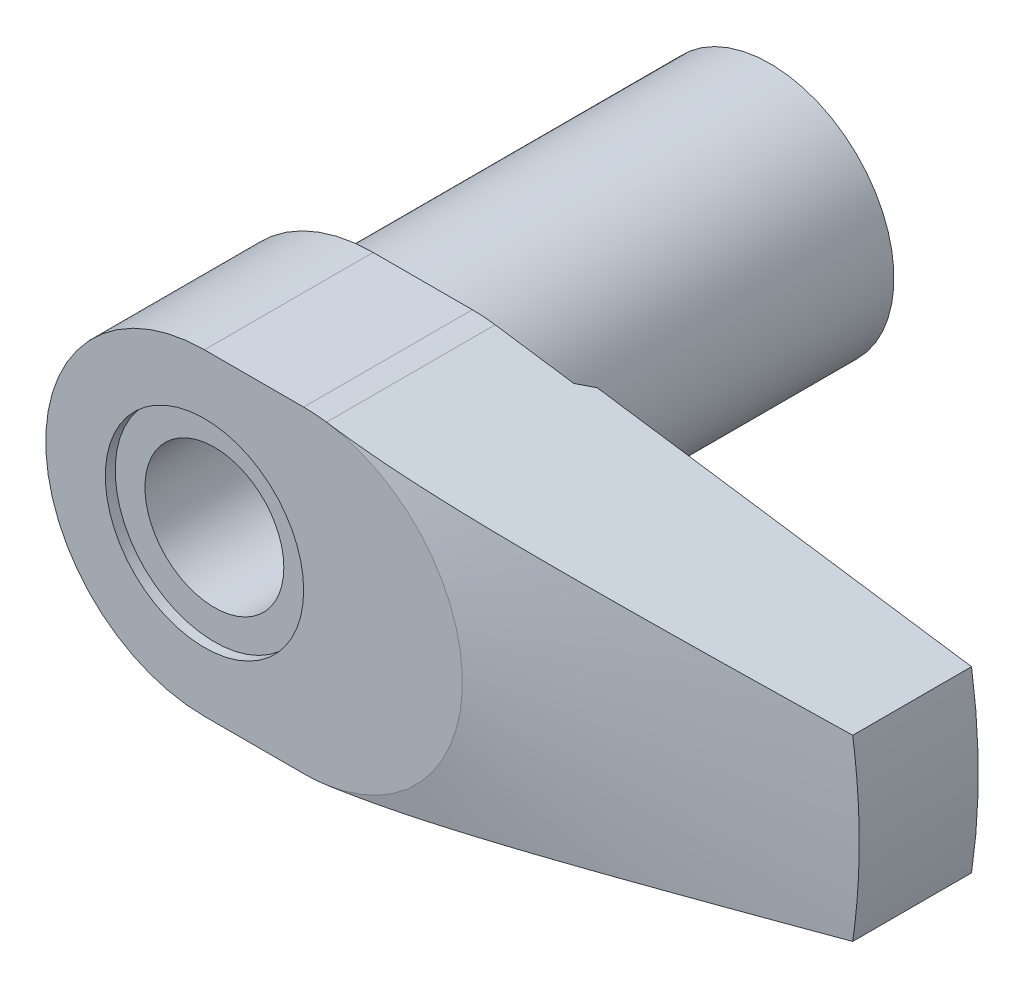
ISO-10303-21;
HEADER;
FILE_DESCRIPTION(('STEP AP214'),'2;1');
FILE_NAME('part.step','',(''),(''),'','','');
FILE_SCHEMA(('AUTOMOTIVE_DESIGN { 1 0 10303 214 1 1 1 1 }'));
ENDSEC;
DATA;
#1=APPLICATION_CONTEXT('core data for automotive mechanical design processes');
#2=APPLICATION_PROTOCOL_DEFINITION('international standard','automotive_design',2000,#1);
#3=PRODUCT_CONTEXT('',#1,'mechanical');
#4=PRODUCT('Part','Part','',(#3));
#5=PRODUCT_RELATED_PRODUCT_CATEGORY('part','',(#4));
#6=PRODUCT_DEFINITION_FORMATION('','',#4);
#7=PRODUCT_DEFINITION_CONTEXT('part definition',#1,'design');
#8=PRODUCT_DEFINITION('design','',#6,#7);
#9=PRODUCT_DEFINITION_SHAPE('','',#8);
#10=(LENGTH_UNIT() NAMED_UNIT(*) SI_UNIT(.MILLI.,.METRE.));
#11=(NAMED_UNIT(*) PLANE_ANGLE_UNIT() SI_UNIT($,.RADIAN.));
#12=(NAMED_UNIT(*) SI_UNIT($,.STERADIAN.) SOLID_ANGLE_UNIT());
#13=UNCERTAINTY_MEASURE_WITH_UNIT(LENGTH_MEASURE(1.E-05),#10,'distance_accuracy_value','');
#14=(GEOMETRIC_REPRESENTATION_CONTEXT(3) GLOBAL_UNCERTAINTY_ASSIGNED_CONTEXT((#13)) GLOBAL_UNIT_ASSIGNED_CONTEXT((#10,
#11,#12)) REPRESENTATION_CONTEXT('',''));
#15=CARTESIAN_POINT('',(0.,0.,0.));
#16=DIRECTION('',(0.,0.,1.));
#17=DIRECTION('',(1.,0.,0.));
#18=AXIS2_PLACEMENT_3D('',#15,#16,#17);
#19=CARTESIAN_POINT('',(59.3211597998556,9.,39.));
#20=DIRECTION('',(0.143824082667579,0.989603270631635,0.));
#21=DIRECTION('',(-0.989603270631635,0.143824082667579,0.));
#22=AXIS2_PLACEMENT_3D('',#19,#20,#21);
#23=PLANE('',#22);
#24=DIRECTION('',(0.,0.,1.));
#25=VECTOR('',#24,1.);
#26=CARTESIAN_POINT('',(12.3011853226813,15.8336523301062,39.));
#27=LINE('',#26,#25);
#28=CARTESIAN_POINT('',(12.3011853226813,15.8336523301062,40.));
#29=VERTEX_POINT('',#28);
#30=CARTESIAN_POINT('',(12.3011853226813,15.8336523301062,57.));
#31=VERTEX_POINT('',#30);
#32=EDGE_CURVE('E117',#29,#31,#27,.T.);
#33=ORIENTED_EDGE('',*,*,#32,.T.);
#34=CARTESIAN_POINT('',(12.3009853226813,15.8336813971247,56.9999999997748));
#35=CARTESIAN_POINT('',(12.6349091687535,15.785150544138,57.0000070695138));
#36=CARTESIAN_POINT('',(12.9688301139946,15.7366201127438,56.9981170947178));
#37=CARTESIAN_POINT('',(13.6366278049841,15.6395656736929,56.9905970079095));
#38=CARTESIAN_POINT('',(13.9705045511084,15.5910416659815,56.984966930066));
#39=CARTESIAN_POINT('',(14.9719359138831,15.4454985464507,56.9625492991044));
#40=CARTESIAN_POINT('',(15.6393758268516,15.3484961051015,56.9402343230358));
#41=CARTESIAN_POINT('',(16.9731230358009,15.1546558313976,56.8819118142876));
#42=CARTESIAN_POINT('',(17.6394308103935,15.0578179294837,56.8459151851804));
#43=CARTESIAN_POINT('',(18.9713017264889,14.8642503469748,56.7617059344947));
#44=CARTESIAN_POINT('',(19.6368648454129,14.7675206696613,56.7134929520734));
#45=CARTESIAN_POINT('',(20.9663767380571,14.5742959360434,56.6065704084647));
#46=CARTESIAN_POINT('',(21.6303264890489,14.4778007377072,56.5478731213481));
#47=CARTESIAN_POINT('',(22.9573852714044,14.2849325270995,56.4215740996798));
#48=CARTESIAN_POINT('',(23.6204943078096,14.1885595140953,56.3539724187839));
#49=CARTESIAN_POINT('',(24.9460835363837,13.9959048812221,56.211329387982));
#50=CARTESIAN_POINT('',(25.6085635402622,13.8996232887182,56.1362862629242));
#51=CARTESIAN_POINT('',(26.9328107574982,13.7071636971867,55.9800554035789));
#52=CARTESIAN_POINT('',(27.5945779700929,13.6109856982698,55.8988676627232));
#53=CARTESIAN_POINT('',(28.9051223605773,13.4205176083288,55.7329867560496));
#54=CARTESIAN_POINT('',(29.5539112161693,13.3262258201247,55.648387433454));
#55=CARTESIAN_POINT('',(30.8509595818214,13.1377191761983,55.4751347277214));
#56=CARTESIAN_POINT('',(31.4992190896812,13.0435043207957,55.3864813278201));
#57=CARTESIAN_POINT('',(33.4433276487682,12.7609571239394,55.115496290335));
#58=CARTESIAN_POINT('',(34.7384906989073,12.572724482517,54.9281418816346));
#59=CARTESIAN_POINT('',(37.3274120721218,12.1964633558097,54.5440891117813));
#60=CARTESIAN_POINT('',(38.6211704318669,12.0084348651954,54.3473910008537));
#61=CARTESIAN_POINT('',(41.2076703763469,11.6325256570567,53.9472650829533));
#62=CARTESIAN_POINT('',(42.5004119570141,11.4446449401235,53.7438372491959));
#63=CARTESIAN_POINT('',(45.0880466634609,11.0685708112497,53.3315720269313));
#64=CARTESIAN_POINT('',(46.382938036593,10.8803776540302,53.1227234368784));
#65=CARTESIAN_POINT('',(48.9721284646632,10.5040774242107,52.7012905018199));
#66=CARTESIAN_POINT('',(50.2664275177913,10.3159703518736,52.4887061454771));
#67=CARTESIAN_POINT('',(52.8543782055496,9.93985029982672,52.0607120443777));
#68=CARTESIAN_POINT('',(54.1480299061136,9.75183731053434,51.8453027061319));
#69=CARTESIAN_POINT('',(56.7349541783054,9.37586643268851,51.4122210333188));
#70=CARTESIAN_POINT('',(58.0282267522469,9.1879085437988,51.1945487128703));
#71=CARTESIAN_POINT('',(59.3213597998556,8.99997093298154,50.9760395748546));
#72=B_SPLINE_CURVE_WITH_KNOTS('',3,(#34,#35,#36,#37,#38,#39,#40,#41,#42,#43,#44,#45,#46,#47,#48,
#49,#50,#51,#52,#53,#54,#55,#56,#57,#58,#59,#60,#61,#62,#63,#64,#65,#66,#67,#68,#69,#70,#71),
.UNSPECIFIED.,.F.,.F.,(4,2,2,2,2,2,2,2,2,2,2,2,2,2,2,2,2,2,4),(0.,1.01228518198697,
2.02456111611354,4.04885787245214,6.07154473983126,8.09429135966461,10.1146852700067,
12.1350670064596,14.1559318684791,16.1767988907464,18.1599062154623,20.1430217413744,
24.1093017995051,28.0754757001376,32.0416653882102,36.0168318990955,39.9920104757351,
43.9666231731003,47.9412110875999),.UNSPECIFIED.);
#73=CARTESIAN_POINT('',(59.3211597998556,9.,50.9760733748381));
#74=VERTEX_POINT('',#73);
#75=EDGE_CURVE('E95',#31,#74,#72,.T.);
#76=ORIENTED_EDGE('',*,*,#75,.T.);
#77=DIRECTION('',(0.,0.,1.));
#78=VECTOR('',#77,1.);
#79=CARTESIAN_POINT('',(59.3211597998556,9.,39.));
#80=LINE('',#79,#78);
#81=CARTESIAN_POINT('',(59.3211597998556,9.,39.));
#82=VERTEX_POINT('',#81);
#83=EDGE_CURVE('E123',#82,#74,#80,.T.);
#84=ORIENTED_EDGE('',*,*,#83,.F.);
#85=DIRECTION('',(-0.989603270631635,0.143824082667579,0.));
#86=VECTOR('',#85,1.);
#87=CARTESIAN_POINT('',(59.3211597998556,9.,39.));
#88=LINE('',#87,#86);
#89=CARTESIAN_POINT('',(21.592449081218,14.48330565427,39.));
#90=VERTEX_POINT('',#89);
#91=EDGE_CURVE('E138',#82,#90,#88,.T.);
#92=ORIENTED_EDGE('',*,*,#91,.T.);
#93=CARTESIAN_POINT('',(21.5927159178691,14.4832668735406,38.9998));
#94=CARTESIAN_POINT('',(21.4802697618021,14.4996092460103,39.0840809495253));
#95=CARTESIAN_POINT('',(21.3676650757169,14.5159746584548,39.1681460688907));
#96=CARTESIAN_POINT('',(21.1421297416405,14.5487528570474,39.3358245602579));
#97=CARTESIAN_POINT('',(21.0291990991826,14.5651656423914,39.4194379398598));
#98=CARTESIAN_POINT('',(20.8029990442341,14.5980404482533,39.5861957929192));
#99=CARTESIAN_POINT('',(20.6897296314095,14.6145024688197,39.6693402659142));
#100=CARTESIAN_POINT('',(20.4628388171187,14.6474776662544,39.8351414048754));
#101=CARTESIAN_POINT('',(20.349217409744,14.6639908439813,39.9177980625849));
#102=CARTESIAN_POINT('',(20.2354152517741,14.6805302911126,40.0002));
#103=B_SPLINE_CURVE_WITH_KNOTS('',3,(#93,#94,#95,#96,#97,#98,#99,#100,#101,#102),.UNSPECIFIED.,
.F.,.F.,(4,2,2,2,4),(0.,0.424417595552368,0.848828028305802,1.27323887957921,1.69765689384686),.UNSPECIFIED.);
#104=CARTESIAN_POINT('',(20.2356914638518,14.6804901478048,40.));
#105=VERTEX_POINT('',#104);
#106=EDGE_CURVE('E192',#90,#105,#103,.T.);
#107=ORIENTED_EDGE('',*,*,#106,.T.);
#108=DIRECTION('',(0.989603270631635,-0.143824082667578,0.));
#109=VECTOR('',#108,1.);
#110=CARTESIAN_POINT('',(12.3011853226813,15.8336523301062,40.));
#111=LINE('',#110,#109);
#112=EDGE_CURVE('E119',#29,#105,#111,.T.);
#113=ORIENTED_EDGE('',*,*,#112,.F.);
#114=EDGE_LOOP('',(#33,#76,#84,#92,#107,#113));
#115=FACE_BOUND('',#114,.T.);
#116=ADVANCED_FACE('F14',(#115),#23,.T.);
#117=CARTESIAN_POINT('',(59.3211597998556,-9.,39.));
#118=DIRECTION('',(0.143824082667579,-0.989603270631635,0.));
#119=DIRECTION('',(0.989603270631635,0.143824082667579,0.));
#120=AXIS2_PLACEMENT_3D('',#117,#118,#119);
#121=PLANE('',#120);
#122=DIRECTION('',(0.,0.,1.));
#123=VECTOR('',#122,1.);
#124=CARTESIAN_POINT('',(59.3211597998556,-9.,39.));
#125=LINE('',#124,#123);
#126=CARTESIAN_POINT('',(59.3211597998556,-9.,39.));
#127=VERTEX_POINT('',#126);
#128=CARTESIAN_POINT('',(59.3211597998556,-9.,50.9760733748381));
#129=VERTEX_POINT('',#128);
#130=EDGE_CURVE('E145',#127,#129,#125,.T.);
#131=ORIENTED_EDGE('',*,*,#130,.T.);
#132=CARTESIAN_POINT('',(59.3213597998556,-8.99997093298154,50.9760395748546));
#133=CARTESIAN_POINT('',(58.3469494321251,-9.14158695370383,51.1407059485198));
#134=CARTESIAN_POINT('',(57.3724576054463,-9.2832148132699,51.3048819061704));
#135=CARTESIAN_POINT('',(55.4232742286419,-9.56649955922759,51.6320245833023));
#136=CARTESIAN_POINT('',(54.4485826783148,-9.7081564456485,51.7949913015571));
#137=CARTESIAN_POINT('',(52.4991016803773,-9.99148444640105,52.1194640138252));
#138=CARTESIAN_POINT('',(51.5243122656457,-10.1331555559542,52.2809702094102));
#139=CARTESIAN_POINT('',(49.5744519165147,-10.4165386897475,52.6022387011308));
#140=CARTESIAN_POINT('',(48.5993809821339,-10.5582507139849,52.7620009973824));
#141=CARTESIAN_POINT('',(46.6499435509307,-10.8415723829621,53.0792219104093));
#142=CARTESIAN_POINT('',(45.6755774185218,-10.9831819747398,53.2366828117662));
#143=CARTESIAN_POINT('',(43.7264316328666,-11.2664612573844,53.5489681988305));
#144=CARTESIAN_POINT('',(42.7516519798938,-11.4081309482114,53.7037926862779));
#145=CARTESIAN_POINT('',(40.8014288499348,-11.6915668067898,54.0101609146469));
#146=CARTESIAN_POINT('',(39.8259852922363,-11.8333329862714,54.1617041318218));
#147=CARTESIAN_POINT('',(37.8744646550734,-12.116957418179,54.4605909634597));
#148=CARTESIAN_POINT('',(36.8983875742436,-12.2588156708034,54.6079345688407));
#149=CARTESIAN_POINT('',(34.943686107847,-12.5429023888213,54.8974748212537));
#150=CARTESIAN_POINT('',(33.9650603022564,-12.685131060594,55.0396617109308));
#151=CARTESIAN_POINT('',(32.0068268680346,-12.9697310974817,55.3169515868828));
#152=CARTESIAN_POINT('',(31.0272192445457,-13.1121024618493,55.4520546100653));
#153=CARTESIAN_POINT('',(29.0671415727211,-13.3969705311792,55.7128637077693));
#154=CARTESIAN_POINT('',(28.0866719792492,-13.5394671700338,55.8385732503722));
#155=CARTESIAN_POINT('',(26.124206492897,-13.8246822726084,56.077581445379));
#156=CARTESIAN_POINT('',(25.1422105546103,-13.9674007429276,56.1908797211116));
#157=CARTESIAN_POINT('',(23.1751165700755,-14.2532885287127,56.4011544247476));
#158=CARTESIAN_POINT('',(22.1900161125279,-14.3964581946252,56.4981080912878));
#159=CARTESIAN_POINT('',(20.2180167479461,-14.6830589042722,56.670441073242));
#160=CARTESIAN_POINT('',(19.231118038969,-14.8264899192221,56.7458226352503));
#161=CARTESIAN_POINT('',(17.7489059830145,-15.0419073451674,56.8386947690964));
#162=CARTESIAN_POINT('',(17.2542067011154,-15.1138045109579,56.8662966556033));
#163=CARTESIAN_POINT('',(16.2644594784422,-15.2576495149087,56.9141314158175));
#164=CARTESIAN_POINT('',(15.7694115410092,-15.3295973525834,56.9343643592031));
#165=CARTESIAN_POINT('',(14.7788777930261,-15.4735566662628,56.9669554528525));
#166=CARTESIAN_POINT('',(14.2833918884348,-15.5455681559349,56.9793107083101));
#167=CARTESIAN_POINT('',(13.2922673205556,-15.6896133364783,56.9958528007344));
#168=CARTESIAN_POINT('',(12.7966286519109,-15.7616470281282,57.0000393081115));
#169=CARTESIAN_POINT('',(12.3009853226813,-15.8336813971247,56.9999999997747));
#170=B_SPLINE_CURVE_WITH_KNOTS('',3,(#132,#133,#134,#135,#136,#137,#138,#139,#140,#141,#142,
#143,#144,#145,#146,#147,#148,#149,#150,#151,#152,#153,#154,#155,#156,#157,#158,#159,#160,#161,
#162,#163,#164,#165,#166,#167,#168,#169),.UNSPECIFIED.,.F.,.F.,(4,2,2,2,2,2,2,2,2,2,2,2,2,2,2,2,
2,2,4),(0.,2.99496460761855,5.98993225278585,8.98448004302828,11.9790276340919,14.9703671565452,
17.9617047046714,20.9535162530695,23.9453342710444,26.9425456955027,29.9397415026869,
32.935825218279,35.9319998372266,38.9323130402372,41.9323136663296,43.4342420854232,
44.9361563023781,46.4386221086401,47.9411485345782),.UNSPECIFIED.);
#171=CARTESIAN_POINT('',(12.3011853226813,-15.8336523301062,57.));
#172=VERTEX_POINT('',#171);
#173=EDGE_CURVE('E35',#129,#172,#170,.T.);
#174=ORIENTED_EDGE('',*,*,#173,.T.);
#175=DIRECTION('',(0.,0.,1.));
#176=VECTOR('',#175,1.);
#177=CARTESIAN_POINT('',(12.3011853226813,-15.8336523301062,39.));
#178=LINE('',#177,#176);
#179=CARTESIAN_POINT('',(12.3011853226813,-15.8336523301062,40.));
#180=VERTEX_POINT('',#179);
#181=EDGE_CURVE('E148',#180,#172,#178,.T.);
#182=ORIENTED_EDGE('',*,*,#181,.F.);
#183=DIRECTION('',(-0.989603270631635,-0.143824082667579,0.));
#184=VECTOR('',#183,1.);
#185=CARTESIAN_POINT('',(20.2356914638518,-14.6804901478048,40.));
#186=LINE('',#185,#184);
#187=CARTESIAN_POINT('',(20.2356914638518,-14.6804901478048,40.));
#188=VERTEX_POINT('',#187);
#189=EDGE_CURVE('E102',#188,#180,#186,.T.);
#190=ORIENTED_EDGE('',*,*,#189,.F.);
#191=CARTESIAN_POINT('',(20.2354152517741,-14.6805302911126,40.0002));
#192=CARTESIAN_POINT('',(20.349217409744,-14.6639908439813,39.9177980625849));
#193=CARTESIAN_POINT('',(20.4628388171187,-14.6474776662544,39.8351414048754));
#194=CARTESIAN_POINT('',(20.6897296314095,-14.6145024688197,39.6693402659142));
#195=CARTESIAN_POINT('',(20.8029990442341,-14.5980404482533,39.5861957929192));
#196=CARTESIAN_POINT('',(21.0291990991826,-14.5651656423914,39.4194379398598));
#197=CARTESIAN_POINT('',(21.1421297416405,-14.5487528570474,39.3358245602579));
#198=CARTESIAN_POINT('',(21.3676650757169,-14.5159746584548,39.1681460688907));
#199=CARTESIAN_POINT('',(21.4802697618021,-14.4996092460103,39.0840809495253));
#200=CARTESIAN_POINT('',(21.5927159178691,-14.4832668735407,38.9998));
#201=B_SPLINE_CURVE_WITH_KNOTS('',3,(#191,#192,#193,#194,#195,#196,#197,#198,#199,#200),
.UNSPECIFIED.,.F.,.F.,(4,2,2,2,4),(0.,0.424418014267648,0.848828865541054,1.27323929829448,
1.69765689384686),.UNSPECIFIED.);
#202=CARTESIAN_POINT('',(21.592449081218,-14.48330565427,39.));
#203=VERTEX_POINT('',#202);
#204=EDGE_CURVE('E28',#188,#203,#201,.T.);
#205=ORIENTED_EDGE('',*,*,#204,.T.);
#206=DIRECTION('',(0.989603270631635,0.143824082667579,0.));
#207=VECTOR('',#206,1.);
#208=CARTESIAN_POINT('',(59.3211597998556,-9.,39.));
#209=LINE('',#208,#207);
#210=EDGE_CURVE('E142',#203,#127,#209,.T.);
#211=ORIENTED_EDGE('',*,*,#210,.T.);
#212=EDGE_LOOP('',(#131,#174,#182,#190,#205,#211));
#213=FACE_BOUND('',#212,.T.);
#214=ADVANCED_FACE('F180',(#213),#121,.T.);
#215=CARTESIAN_POINT('',(0.,0.,57.));
#216=DIRECTION('',(0.,0.,1.));
#217=DIRECTION('',(1.,0.,0.));
#218=AXIS2_PLACEMENT_3D('',#215,#216,#217);
#219=PLANE('',#218);
#220=CARTESIAN_POINT('',(0.,0.,57.));
#221=DIRECTION('',(0.,0.,1.));
#222=DIRECTION('',(1.,0.,0.));
#223=AXIS2_PLACEMENT_3D('',#220,#221,#222);
#224=CIRCLE('',#223,10.);
#225=CARTESIAN_POINT('',(10.,0.,57.));
#226=VERTEX_POINT('',#225);
#227=EDGE_CURVE('E122',#226,#226,#224,.T.);
#228=ORIENTED_EDGE('',*,*,#227,.F.);
#229=EDGE_LOOP('',(#228));
#230=FACE_BOUND('',#229,.T.);
#231=CARTESIAN_POINT('',(10.,0.,57.));
#232=DIRECTION('',(0.,0.,1.));
#233=DIRECTION('',(1.,0.,0.));
#234=AXIS2_PLACEMENT_3D('',#231,#232,#233);
#235=CIRCLE('',#234,16.);
#236=CARTESIAN_POINT('',(10.,-16.,57.));
#237=VERTEX_POINT('',#236);
#238=EDGE_CURVE('E113',#237,#172,#235,.T.);
#239=ORIENTED_EDGE('',*,*,#238,.T.);
#240=CARTESIAN_POINT('',(10.,0.,57.));
#241=DIRECTION('',(0.,0.,-1.));
#242=DIRECTION('',(-1.,0.,0.));
#243=AXIS2_PLACEMENT_3D('',#240,#241,#242);
#244=CIRCLE('',#243,16.);
#245=EDGE_CURVE('E98',#31,#172,#244,.T.);
#246=ORIENTED_EDGE('',*,*,#245,.F.);
#247=CARTESIAN_POINT('',(10.,0.,57.));
#248=DIRECTION('',(0.,0.,1.));
#249=DIRECTION('',(1.,0.,0.));
#250=AXIS2_PLACEMENT_3D('',#247,#248,#249);
#251=CIRCLE('',#250,16.);
#252=CARTESIAN_POINT('',(10.,16.,57.));
#253=VERTEX_POINT('',#252);
#254=EDGE_CURVE('E110',#31,#253,#251,.T.);
#255=ORIENTED_EDGE('',*,*,#254,.T.);
#256=DIRECTION('',(-1.,0.,0.));
#257=VECTOR('',#256,1.);
#258=CARTESIAN_POINT('',(10.,16.,57.));
#259=LINE('',#258,#257);
#260=CARTESIAN_POINT('',(0.,16.,57.));
#261=VERTEX_POINT('',#260);
#262=EDGE_CURVE('E129',#253,#261,#259,.T.);
#263=ORIENTED_EDGE('',*,*,#262,.T.);
#264=CARTESIAN_POINT('',(0.,0.,57.));
#265=DIRECTION('',(0.,0.,1.));
#266=DIRECTION('',(1.,0.,0.));
#267=AXIS2_PLACEMENT_3D('',#264,#265,#266);
#268=CIRCLE('',#267,16.);
#269=CARTESIAN_POINT('',(1.6759120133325E-13,-16.,57.));
#270=VERTEX_POINT('',#269);
#271=EDGE_CURVE('E170',#261,#270,#268,.T.);
#272=ORIENTED_EDGE('',*,*,#271,.T.);
#273=DIRECTION('',(1.,0.,0.));
#274=VECTOR('',#273,1.);
#275=CARTESIAN_POINT('',(1.6759120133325E-13,-16.,57.));
#276=LINE('',#275,#274);
#277=EDGE_CURVE('E132',#270,#237,#276,.T.);
#278=ORIENTED_EDGE('',*,*,#277,.T.);
#279=EDGE_LOOP('',(#239,#246,#255,#263,#272,#278));
#280=FACE_BOUND('',#279,.T.);
#281=ADVANCED_FACE('F107',(#230,#280),#219,.T.);
#282=CARTESIAN_POINT('',(0.,0.,39.));
#283=DIRECTION('',(0.,0.,1.));
#284=DIRECTION('',(1.,0.,0.));
#285=AXIS2_PLACEMENT_3D('',#282,#283,#284);
#286=CYLINDRICAL_SURFACE('',#285,60.);
#287=ORIENTED_EDGE('',*,*,#83,.T.);
#288=CARTESIAN_POINT('',(59.3211294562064,9.0002,50.9760723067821));
#289=CARTESIAN_POINT('',(59.4343867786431,8.25371603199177,50.9800589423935));
#290=CARTESIAN_POINT('',(59.5335412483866,7.50515703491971,50.9835515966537));
#291=CARTESIAN_POINT('',(59.7035346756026,6.00482909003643,50.9895421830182));
#292=CARTESIAN_POINT('',(59.7743737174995,5.25306015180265,50.9920401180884));
#293=CARTESIAN_POINT('',(59.9435951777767,3.00309994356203,50.9980085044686));
#294=CARTESIAN_POINT('',(60.,1.50154997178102,51.));
#295=CARTESIAN_POINT('',(60.,-1.50154997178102,51.));
#296=CARTESIAN_POINT('',(59.9435951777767,-3.00309994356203,50.9980085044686));
#297=CARTESIAN_POINT('',(59.7743737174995,-5.25306015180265,50.9920401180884));
#298=CARTESIAN_POINT('',(59.7035346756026,-6.00482909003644,50.9895421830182));
#299=CARTESIAN_POINT('',(59.5335412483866,-7.50515703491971,50.9835515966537));
#300=CARTESIAN_POINT('',(59.4343867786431,-8.25371603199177,50.9800589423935));
#301=CARTESIAN_POINT('',(59.3211294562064,-9.0002,50.9760723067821));
#302=B_SPLINE_CURVE_WITH_KNOTS('',3,(#288,#289,#290,#291,#292,#293,#294,#295,#296,#297,#298,
#299,#300,#301),.UNSPECIFIED.,.F.,.F.,(4,2,2,2,2,2,4),(0.,2.26484454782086,4.52968234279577,
9.03301255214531,13.5363427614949,15.8011805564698,18.0660251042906),.UNSPECIFIED.);
#303=EDGE_CURVE('E9',#74,#129,#302,.T.);
#304=ORIENTED_EDGE('',*,*,#303,.T.);
#305=ORIENTED_EDGE('',*,*,#130,.F.);
#306=CARTESIAN_POINT('',(0.,0.,39.));
#307=DIRECTION('',(0.,0.,1.));
#308=DIRECTION('',(1.,0.,0.));
#309=AXIS2_PLACEMENT_3D('',#306,#307,#308);
#310=CIRCLE('',#309,60.);
#311=EDGE_CURVE('E410',#127,#82,#310,.T.);
#312=ORIENTED_EDGE('',*,*,#311,.T.);
#313=EDGE_LOOP('',(#287,#304,#305,#312));
#314=FACE_BOUND('',#313,.T.);
#315=ADVANCED_FACE('F203',(#314),#286,.T.);
#316=CARTESIAN_POINT('',(10.,0.,39.));
#317=DIRECTION('',(0.,0.,1.));
#318=DIRECTION('',(1.,0.,0.));
#319=AXIS2_PLACEMENT_3D('',#316,#317,#318);
#320=CYLINDRICAL_SURFACE('',#319,16.);
#321=ORIENTED_EDGE('',*,*,#32,.F.);
#322=CARTESIAN_POINT('',(10.,0.,40.));
#323=DIRECTION('',(0.,0.,-1.));
#324=DIRECTION('',(-1.,0.,0.));
#325=AXIS2_PLACEMENT_3D('',#322,#323,#324);
#326=CIRCLE('',#325,16.);
#327=CARTESIAN_POINT('',(10.,16.,40.));
#328=VERTEX_POINT('',#327);
#329=EDGE_CURVE('E223',#328,#29,#326,.T.);
#330=ORIENTED_EDGE('',*,*,#329,.F.);
#331=DIRECTION('',(0.,0.,1.));
#332=VECTOR('',#331,1.);
#333=CARTESIAN_POINT('',(10.,16.,39.));
#334=LINE('',#333,#332);
#335=EDGE_CURVE('E127',#328,#253,#334,.T.);
#336=ORIENTED_EDGE('',*,*,#335,.T.);
#337=ORIENTED_EDGE('',*,*,#254,.F.);
#338=EDGE_LOOP('',(#321,#330,#336,#337));
#339=FACE_BOUND('',#338,.T.);
#340=ADVANCED_FACE('F125',(#339),#320,.T.);
#341=CARTESIAN_POINT('',(10.,0.,39.));
#342=DIRECTION('',(0.,0.,1.));
#343=DIRECTION('',(1.,0.,0.));
#344=AXIS2_PLACEMENT_3D('',#341,#342,#343);
#345=CYLINDRICAL_SURFACE('',#344,16.);
#346=DIRECTION('',(0.,0.,1.));
#347=VECTOR('',#346,1.);
#348=CARTESIAN_POINT('',(10.,-16.,39.));
#349=LINE('',#348,#347);
#350=CARTESIAN_POINT('',(10.,-16.,40.));
#351=VERTEX_POINT('',#350);
#352=EDGE_CURVE('E151',#351,#237,#349,.T.);
#353=ORIENTED_EDGE('',*,*,#352,.F.);
#354=CARTESIAN_POINT('',(10.,0.,40.));
#355=DIRECTION('',(0.,0.,-1.));
#356=DIRECTION('',(-1.,0.,0.));
#357=AXIS2_PLACEMENT_3D('',#354,#355,#356);
#358=CIRCLE('',#357,16.);
#359=EDGE_CURVE('E217',#180,#351,#358,.T.);
#360=ORIENTED_EDGE('',*,*,#359,.F.);
#361=ORIENTED_EDGE('',*,*,#181,.T.);
#362=ORIENTED_EDGE('',*,*,#238,.F.);
#363=EDGE_LOOP('',(#353,#360,#361,#362));
#364=FACE_BOUND('',#363,.T.);
#365=ADVANCED_FACE('F235',(#364),#345,.T.);
#366=CARTESIAN_POINT('',(1.6759120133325E-13,-16.,39.));
#367=DIRECTION('',(0.,-1.,0.));
#368=DIRECTION('',(1.,0.,0.));
#369=AXIS2_PLACEMENT_3D('',#366,#367,#368);
#370=PLANE('',#369);
#371=DIRECTION('',(0.,0.,1.));
#372=VECTOR('',#371,1.);
#373=CARTESIAN_POINT('',(1.6759120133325E-13,-16.,39.));
#374=LINE('',#373,#372);
#375=CARTESIAN_POINT('',(0.,-16.,40.));
#376=VERTEX_POINT('',#375);
#377=EDGE_CURVE('E153',#376,#270,#374,.T.);
#378=ORIENTED_EDGE('',*,*,#377,.F.);
#379=DIRECTION('',(-1.,0.,0.));
#380=VECTOR('',#379,1.);
#381=CARTESIAN_POINT('',(10.,-16.,40.));
#382=LINE('',#381,#380);
#383=EDGE_CURVE('E219',#351,#376,#382,.T.);
#384=ORIENTED_EDGE('',*,*,#383,.F.);
#385=ORIENTED_EDGE('',*,*,#352,.T.);
#386=ORIENTED_EDGE('',*,*,#277,.F.);
#387=EDGE_LOOP('',(#378,#384,#385,#386));
#388=FACE_BOUND('',#387,.T.);
#389=ADVANCED_FACE('F240',(#388),#370,.T.);
#390=CARTESIAN_POINT('',(10.,16.,39.));
#391=DIRECTION('',(0.,1.,0.));
#392=DIRECTION('',(-1.,0.,0.));
#393=AXIS2_PLACEMENT_3D('',#390,#391,#392);
#394=PLANE('',#393);
#395=ORIENTED_EDGE('',*,*,#335,.F.);
#396=DIRECTION('',(1.,0.,0.));
#397=VECTOR('',#396,1.);
#398=CARTESIAN_POINT('',(0.,16.,40.));
#399=LINE('',#398,#397);
#400=CARTESIAN_POINT('',(0.,16.,40.));
#401=VERTEX_POINT('',#400);
#402=EDGE_CURVE('E221',#401,#328,#399,.T.);
#403=ORIENTED_EDGE('',*,*,#402,.F.);
#404=DIRECTION('',(0.,0.,1.));
#405=VECTOR('',#404,1.);
#406=CARTESIAN_POINT('',(0.,16.,39.));
#407=LINE('',#406,#405);
#408=EDGE_CURVE('E155',#401,#261,#407,.T.);
#409=ORIENTED_EDGE('',*,*,#408,.T.);
#410=ORIENTED_EDGE('',*,*,#262,.F.);
#411=EDGE_LOOP('',(#395,#403,#409,#410));
#412=FACE_BOUND('',#411,.T.);
#413=ADVANCED_FACE('F246',(#412),#394,.T.);
#414=CARTESIAN_POINT('',(70.,20.,39.));
#415=DIRECTION('',(0.,0.,1.));
#416=DIRECTION('',(1.,0.,0.));
#417=AXIS2_PLACEMENT_3D('',#414,#415,#416);
#418=PLANE('',#417);
#419=CARTESIAN_POINT('',(0.,0.,39.));
#420=DIRECTION('',(0.,0.,-1.));
#421=DIRECTION('',(-1.,0.,0.));
#422=AXIS2_PLACEMENT_3D('',#419,#420,#421);
#423=CIRCLE('',#422,26.);
#424=EDGE_CURVE('E42',#90,#203,#423,.T.);
#425=ORIENTED_EDGE('',*,*,#424,.F.);
#426=ORIENTED_EDGE('',*,*,#91,.F.);
#427=ORIENTED_EDGE('',*,*,#311,.F.);
#428=ORIENTED_EDGE('',*,*,#210,.F.);
#429=EDGE_LOOP('',(#425,#426,#427,#428));
#430=FACE_BOUND('',#429,.T.);
#431=ADVANCED_FACE('F248',(#430),#418,.F.);
#432=CARTESIAN_POINT('',(0.,0.,57.));
#433=DIRECTION('',(0.,0.,-1.));
#434=DIRECTION('',(-1.,0.,0.));
#435=AXIS2_PLACEMENT_3D('',#432,#433,#434);
#436=CYLINDRICAL_SURFACE('',#435,7.);
#437=CARTESIAN_POINT('',(0.,0.,0.));
#438=DIRECTION('',(0.,0.,1.));
#439=DIRECTION('',(1.,0.,0.));
#440=AXIS2_PLACEMENT_3D('',#437,#438,#439);
#441=CIRCLE('',#440,7.);
#442=CARTESIAN_POINT('',(7.,0.,0.));
#443=VERTEX_POINT('',#442);
#444=EDGE_CURVE('E167',#443,#443,#441,.T.);
#445=ORIENTED_EDGE('',*,*,#444,.F.);
#446=EDGE_LOOP('',(#445));
#447=FACE_BOUND('',#446,.T.);
#448=CARTESIAN_POINT('',(0.,0.,56.));
#449=DIRECTION('',(0.,0.,1.));
#450=DIRECTION('',(1.,0.,0.));
#451=AXIS2_PLACEMENT_3D('',#448,#449,#450);
#452=CIRCLE('',#451,7.);
#453=CARTESIAN_POINT('',(7.,0.,56.));
#454=VERTEX_POINT('',#453);
#455=EDGE_CURVE('E161',#454,#454,#452,.T.);
#456=ORIENTED_EDGE('',*,*,#455,.T.);
#457=EDGE_LOOP('',(#456));
#458=FACE_BOUND('',#457,.T.);
#459=ADVANCED_FACE('F256',(#447,#458),#436,.F.);
#460=CARTESIAN_POINT('',(0.,0.,0.));
#461=DIRECTION('',(0.,0.,1.));
#462=DIRECTION('',(1.,0.,0.));
#463=AXIS2_PLACEMENT_3D('',#460,#461,#462);
#464=PLANE('',#463);
#465=ORIENTED_EDGE('',*,*,#444,.T.);
#466=EDGE_LOOP('',(#465));
#467=FACE_BOUND('',#466,.T.);
#468=CARTESIAN_POINT('',(0.,0.,0.));
#469=DIRECTION('',(0.,0.,-1.));
#470=DIRECTION('',(-1.,0.,0.));
#471=AXIS2_PLACEMENT_3D('',#468,#469,#470);
#472=CIRCLE('',#471,12.5);
#473=CARTESIAN_POINT('',(-12.5,0.,0.));
#474=VERTEX_POINT('',#473);
#475=EDGE_CURVE('E164',#474,#474,#472,.T.);
#476=ORIENTED_EDGE('',*,*,#475,.T.);
#477=EDGE_LOOP('',(#476));
#478=FACE_BOUND('',#477,.T.);
#479=ADVANCED_FACE('F277',(#467,#478),#464,.F.);
#480=CARTESIAN_POINT('',(0.,0.,57.));
#481=DIRECTION('',(0.,0.,-1.));
#482=DIRECTION('',(-1.,0.,0.));
#483=AXIS2_PLACEMENT_3D('',#480,#481,#482);
#484=CYLINDRICAL_SURFACE('',#483,16.);
#485=ORIENTED_EDGE('',*,*,#408,.F.);
#486=CARTESIAN_POINT('',(0.,0.,40.));
#487=DIRECTION('',(0.,0.,-1.));
#488=DIRECTION('',(-1.,0.,0.));
#489=AXIS2_PLACEMENT_3D('',#486,#487,#488);
#490=CIRCLE('',#489,16.);
#491=EDGE_CURVE('E135',#376,#401,#490,.T.);
#492=ORIENTED_EDGE('',*,*,#491,.F.);
#493=ORIENTED_EDGE('',*,*,#377,.T.);
#494=ORIENTED_EDGE('',*,*,#271,.F.);
#495=EDGE_LOOP('',(#485,#492,#493,#494));
#496=FACE_BOUND('',#495,.T.);
#497=ADVANCED_FACE('F16',(#496),#484,.T.);
#498=CARTESIAN_POINT('',(0.,0.,39.));
#499=DIRECTION('',(0.,0.,-1.));
#500=DIRECTION('',(-1.,0.,0.));
#501=AXIS2_PLACEMENT_3D('',#498,#499,#500);
#502=CYLINDRICAL_SURFACE('',#501,12.5);
#503=ORIENTED_EDGE('',*,*,#475,.F.);
#504=EDGE_LOOP('',(#503));
#505=FACE_BOUND('',#504,.T.);
#506=CARTESIAN_POINT('',(0.,0.,40.));
#507=DIRECTION('',(0.,0.,-1.));
#508=DIRECTION('',(-1.,0.,0.));
#509=AXIS2_PLACEMENT_3D('',#506,#507,#508);
#510=CIRCLE('',#509,12.5);
#511=CARTESIAN_POINT('',(-12.5,0.,40.));
#512=VERTEX_POINT('',#511);
#513=EDGE_CURVE('E130',#512,#512,#510,.T.);
#514=ORIENTED_EDGE('',*,*,#513,.T.);
#515=EDGE_LOOP('',(#514));
#516=FACE_BOUND('',#515,.T.);
#517=ADVANCED_FACE('F270',(#505,#516),#502,.T.);
#518=CARTESIAN_POINT('',(0.,0.,56.));
#519=DIRECTION('',(0.,0.,1.));
#520=DIRECTION('',(1.,0.,0.));
#521=AXIS2_PLACEMENT_3D('',#518,#519,#520);
#522=CYLINDRICAL_SURFACE('',#521,10.);
#523=CARTESIAN_POINT('',(0.,0.,56.));
#524=DIRECTION('',(0.,0.,1.));
#525=DIRECTION('',(1.,0.,0.));
#526=AXIS2_PLACEMENT_3D('',#523,#524,#525);
#527=CIRCLE('',#526,10.);
#528=CARTESIAN_POINT('',(10.,0.,56.));
#529=VERTEX_POINT('',#528);
#530=EDGE_CURVE('E158',#529,#529,#527,.T.);
#531=ORIENTED_EDGE('',*,*,#530,.F.);
#532=EDGE_LOOP('',(#531));
#533=FACE_BOUND('',#532,.T.);
#534=ORIENTED_EDGE('',*,*,#227,.T.);
#535=EDGE_LOOP('',(#534));
#536=FACE_BOUND('',#535,.T.);
#537=ADVANCED_FACE('F266',(#533,#536),#522,.F.);
#538=CARTESIAN_POINT('',(0.,0.,56.));
#539=DIRECTION('',(0.,0.,1.));
#540=DIRECTION('',(1.,0.,0.));
#541=AXIS2_PLACEMENT_3D('',#538,#539,#540);
#542=PLANE('',#541);
#543=ORIENTED_EDGE('',*,*,#455,.F.);
#544=EDGE_LOOP('',(#543));
#545=FACE_BOUND('',#544,.T.);
#546=ORIENTED_EDGE('',*,*,#530,.T.);
#547=EDGE_LOOP('',(#546));
#548=FACE_BOUND('',#547,.T.);
#549=ADVANCED_FACE('F263',(#545,#548),#542,.T.);
#550=CARTESIAN_POINT('',(-12.5,0.,40.));
#551=DIRECTION('',(0.,0.,1.));
#552=DIRECTION('',(1.,0.,0.));
#553=AXIS2_PLACEMENT_3D('',#550,#551,#552);
#554=PLANE('',#553);
#555=ORIENTED_EDGE('',*,*,#513,.F.);
#556=EDGE_LOOP('',(#555));
#557=FACE_BOUND('',#556,.T.);
#558=ORIENTED_EDGE('',*,*,#491,.T.);
#559=ORIENTED_EDGE('',*,*,#402,.T.);
#560=ORIENTED_EDGE('',*,*,#329,.T.);
#561=ORIENTED_EDGE('',*,*,#112,.T.);
#562=CARTESIAN_POINT('',(0.,0.,40.));
#563=DIRECTION('',(0.,0.,-1.));
#564=DIRECTION('',(-1.,0.,0.));
#565=AXIS2_PLACEMENT_3D('',#562,#563,#564);
#566=CIRCLE('',#565,25.);
#567=EDGE_CURVE('E199',#105,#188,#566,.T.);
#568=ORIENTED_EDGE('',*,*,#567,.T.);
#569=ORIENTED_EDGE('',*,*,#189,.T.);
#570=ORIENTED_EDGE('',*,*,#359,.T.);
#571=ORIENTED_EDGE('',*,*,#383,.T.);
#572=EDGE_LOOP('',(#558,#559,#560,#561,#568,#569,#570,#571));
#573=FACE_BOUND('',#572,.T.);
#574=ADVANCED_FACE('F187',(#557,#573),#554,.F.);
#575=CARTESIAN_POINT('',(0.,0.,40.));
#576=DIRECTION('',(0.,0.,-1.));
#577=DIRECTION('',(-1.,0.,0.));
#578=AXIS2_PLACEMENT_3D('',#575,#576,#577);
#579=CONICAL_SURFACE('',#578,25.,0.785398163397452);
#580=ORIENTED_EDGE('',*,*,#424,.T.);
#581=ORIENTED_EDGE('',*,*,#204,.F.);
#582=ORIENTED_EDGE('',*,*,#567,.F.);
#583=ORIENTED_EDGE('',*,*,#106,.F.);
#584=EDGE_LOOP('',(#580,#581,#582,#583));
#585=FACE_BOUND('',#584,.T.);
#586=ADVANCED_FACE('F183',(#585),#579,.F.);
#587=CARTESIAN_POINT('',(10.,0.,47.6589925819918));
#588=DIRECTION('',(0.,0.,-1.));
#589=DIRECTION('',(-1.,0.,0.));
#590=AXIS2_PLACEMENT_3D('',#587,#588,#589);
#591=CONICAL_SURFACE('',#590,68.9323753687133,1.39612412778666);
#592=ORIENTED_EDGE('',*,*,#245,.T.);
#593=ORIENTED_EDGE('',*,*,#173,.F.);
#594=ORIENTED_EDGE('',*,*,#303,.F.);
#595=ORIENTED_EDGE('',*,*,#75,.F.);
#596=EDGE_LOOP('',(#592,#593,#594,#595));
#597=FACE_BOUND('',#596,.T.);
#598=ADVANCED_FACE('F97',(#597),#591,.T.);
#599=CLOSED_SHELL('',(#116,#214,#281,#315,#340,#365,#389,#413,#431,#459,#479,#497,#517,#537,
#549,#574,#586,#598));
#600=MANIFOLD_SOLID_BREP('B1',#599);
#601=ADVANCED_BREP_SHAPE_REPRESENTATION('',(#18,#600),#14);
#602=SHAPE_DEFINITION_REPRESENTATION(#9,#601);
ENDSEC;
END-ISO-10303-21;
